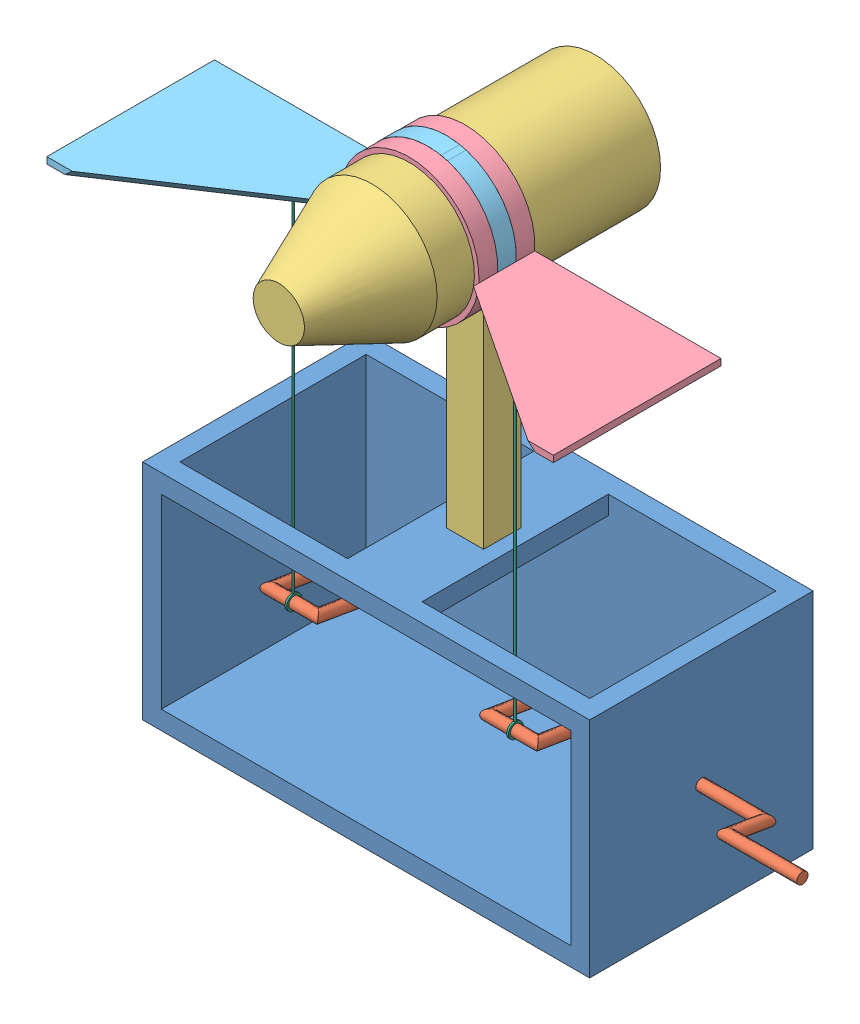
SolidWorks assembly Initial design.SLDASM, configuration Default (file format 11000). Lengths in mm.
Overall size (330.93 366.56 170.01).
7 component instances, 6 part files, 14 mates.
Components (placement in the parent):
- Box For project-1: Box For project.SLDPRT [Default] at (58.3363 82.3993 71.5275) size (240 120 120)
- Crank Shaft-1: Crank Shaft.SLDPRT [Default] at (172.3363 82.3993 131.5275) x (1 0 0) z (0 0.98591 -0.167275) size (314 39.5 28)
- Bird Body-1: Bird Body.SLDPRT [Default] at (60.5468 297.3993 190.6436) size (70 190 170.01)
- wing double ring-1: wing double ring.SLDPRT [Default] at (60.5468 297.3993 160.6436) x (0.75 -0.661438 0) z (0 0 1) size (144.52 126.51 90)
- Wing-1: Wing.SLDPRT [Default] at (60.5468 297.3993 167.7636) x (0.75 0.661438 0) z (0 0 1) size (144.52 126.51 90)
- Rod-1: Rod.SLDPRT [Default] at (-11.6637 87.4176 161.1048) x (0 0 -1) z (1 0 0) size (8 208 1)
- Rod-2: Rod.SLDPRT [Default] at (107.3363 87.4176 161.1048) x (0 0 -1) z (1 0 0) size (8 208 1)
Mates (geometry in assembly coordinates):
- Coincident2: coincident: circle of Box For project-1; circle of Crank Shaft-1
- Coincident6: coincident: line of Bird Body-1 through (50.5468 142.3993 140.6436) axis (1 0 0); line of assembly
- Coincident7: coincident: line of Bird Body-1 through (50.5468 142.3993 120.6436) axis (0 0 1); line of assembly
- Concentric4: concentric: cylinder of Bird Body-1 through (60.5468 297.3993 70.6436) axis (0 0 1) radius 35; cylinder of wing double ring-1 through (60.5468 297.3993 160.6436) axis (0 0 1) radius 35
- Coincident11: coincident: plane of Bird Body-1 through (70.5468 142.3993 140.6436) normal (0 0 1); plane of wing double ring-1 through (79.0397 307.7569 140.6436) normal (0 0 -1)
- Concentric5: concentric: cylinder of Bird Body-1 through (60.5468 297.3993 70.6436) axis (0 0 1) radius 35; cylinder of Wing-1 through (60.5468 297.3993 137.7736) axis (0 0 1) radius 35
- Coincident12: coincident: circle of wing double ring-1; circle of Wing-1
- Concentric8: concentric: cylinder of Crank Shaft-1 through (8.5363 87.4176 161.1048) axis (-1 0 0) radius 3; cylinder of Rod-1 through (-12.6637 87.4176 161.1048) axis (1 0 0) radius 3
- Distance4: distance = 40 mm: plane of Rod-1 through (-11.6637 87.4176 161.1048) normal (-1 0 0); plane of Box For project-1 through (-51.6637 22.3993 191.5275) normal (1 0 0)
- Tangent5: tangent: plane of Wing-1 through (-76.8695 291.4176 107.7736) normal (0 -1 0); circle of Rod-1
- Coincident17: coincident: plane of Wing-1 through (-76.8695 291.4176 107.7736) normal (0 -1 0); plane of Rod-1 through (-11.1637 291.4176 161.1048) normal (0 1 0)
- Concentric10: concentric: cylinder of Crank Shaft-1 through (126.5363 87.4176 161.1048) axis (-1 0 0) radius 3; cylinder of Rod-2 through (106.3363 87.4176 161.1048) axis (1 0 0) radius 3
- Distance6: distance = 60 mm: plane of Rod-2 through (108.3363 87.4176 161.1048) normal (1 0 0); plane of Box For project-1 through (168.3363 22.3993 191.5275) normal (-1 0 0)
- Tangent6: tangent: plane of wing double ring-1 through (197.9631 291.4176 110.6436) normal (0 -1 0); circle of Rod-2
